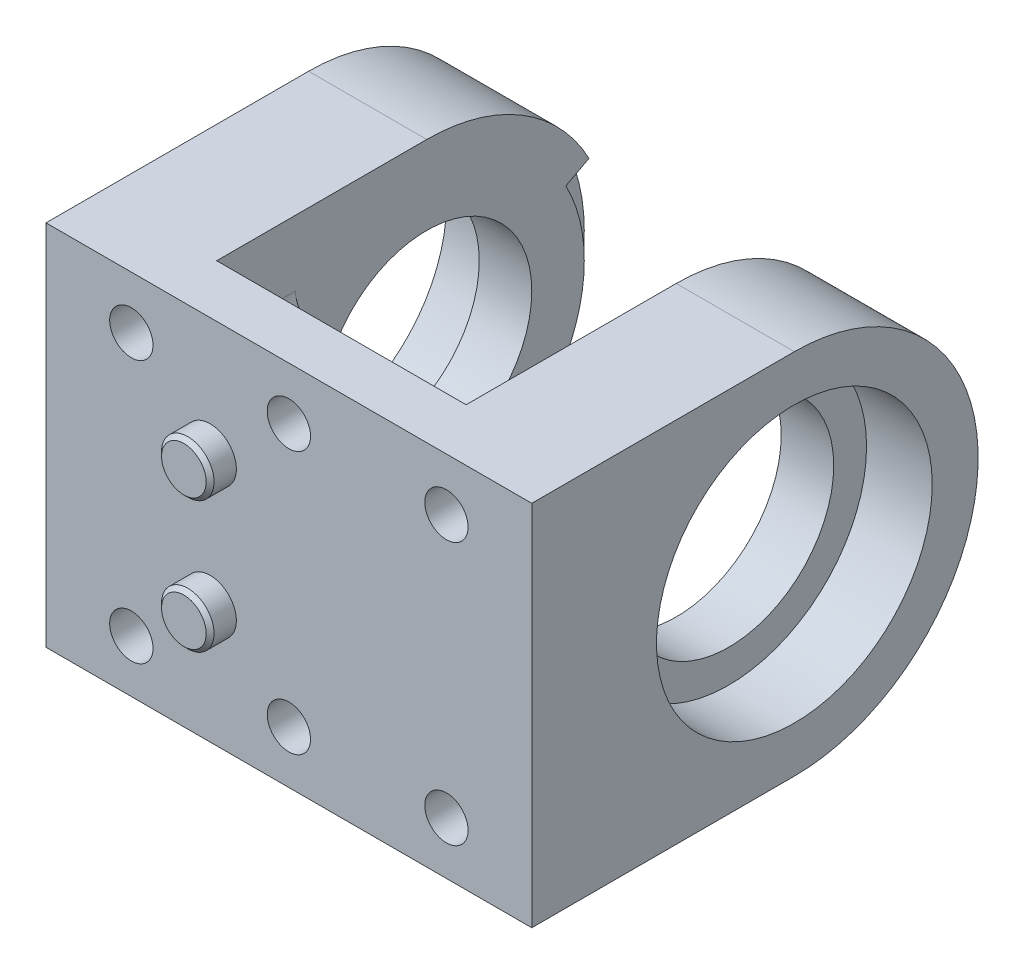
ISO-10303-21;
HEADER;
FILE_DESCRIPTION(('STEP AP214'),'2;1');
FILE_NAME('part.step','',(''),(''),'','','');
FILE_SCHEMA(('AUTOMOTIVE_DESIGN { 1 0 10303 214 1 1 1 1 }'));
ENDSEC;
DATA;
#1=APPLICATION_CONTEXT('core data for automotive mechanical design processes');
#2=APPLICATION_PROTOCOL_DEFINITION('international standard','automotive_design',2000,#1);
#3=PRODUCT_CONTEXT('',#1,'mechanical');
#4=PRODUCT('Part','Part','',(#3));
#5=PRODUCT_RELATED_PRODUCT_CATEGORY('part','',(#4));
#6=PRODUCT_DEFINITION_FORMATION('','',#4);
#7=PRODUCT_DEFINITION_CONTEXT('part definition',#1,'design');
#8=PRODUCT_DEFINITION('design','',#6,#7);
#9=PRODUCT_DEFINITION_SHAPE('','',#8);
#10=(LENGTH_UNIT() NAMED_UNIT(*) SI_UNIT(.MILLI.,.METRE.));
#11=(NAMED_UNIT(*) PLANE_ANGLE_UNIT() SI_UNIT($,.RADIAN.));
#12=(NAMED_UNIT(*) SI_UNIT($,.STERADIAN.) SOLID_ANGLE_UNIT());
#13=UNCERTAINTY_MEASURE_WITH_UNIT(LENGTH_MEASURE(1.E-05),#10,'distance_accuracy_value','');
#14=(GEOMETRIC_REPRESENTATION_CONTEXT(3) GLOBAL_UNCERTAINTY_ASSIGNED_CONTEXT((#13)) GLOBAL_UNIT_ASSIGNED_CONTEXT((#10,
#11,#12)) REPRESENTATION_CONTEXT('',''));
#15=CARTESIAN_POINT('',(0.,0.,0.));
#16=DIRECTION('',(0.,0.,1.));
#17=DIRECTION('',(1.,0.,0.));
#18=AXIS2_PLACEMENT_3D('',#15,#16,#17);
#19=CARTESIAN_POINT('',(0.,0.,0.));
#20=DIRECTION('',(0.,0.,-1.));
#21=DIRECTION('',(-1.,0.,0.));
#22=AXIS2_PLACEMENT_3D('',#19,#20,#21);
#23=PLANE('',#22);
#24=CARTESIAN_POINT('',(0.,-10.,0.));
#25=DIRECTION('',(0.,0.,-1.));
#26=DIRECTION('',(-1.,0.,0.));
#27=AXIS2_PLACEMENT_3D('',#24,#25,#26);
#28=CIRCLE('',#27,1.64999999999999);
#29=CARTESIAN_POINT('',(-1.64999999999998,-10.,0.));
#30=VERTEX_POINT('',#29);
#31=EDGE_CURVE('E277',#30,#30,#28,.T.);
#32=ORIENTED_EDGE('',*,*,#31,.F.);
#33=EDGE_LOOP('',(#32));
#34=FACE_BOUND('',#33,.T.);
#35=DIRECTION('',(0.,-1.,0.));
#36=VECTOR('',#35,1.);
#37=CARTESIAN_POINT('',(-9.5,14.,0.));
#38=LINE('',#37,#36);
#39=CARTESIAN_POINT('',(-9.5,-9.,0.));
#40=VERTEX_POINT('',#39);
#41=CARTESIAN_POINT('',(-9.5,-14.,0.));
#42=VERTEX_POINT('',#41);
#43=EDGE_CURVE('E352',#40,#42,#38,.T.);
#44=ORIENTED_EDGE('',*,*,#43,.F.);
#45=CARTESIAN_POINT('',(-7.5,-9.,0.));
#46=DIRECTION('',(0.,0.,-1.));
#47=DIRECTION('',(-1.,0.,0.));
#48=AXIS2_PLACEMENT_3D('',#45,#46,#47);
#49=CIRCLE('',#48,2.);
#50=CARTESIAN_POINT('',(-7.50000000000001,-7.,0.));
#51=VERTEX_POINT('',#50);
#52=EDGE_CURVE('E475',#40,#51,#49,.T.);
#53=ORIENTED_EDGE('',*,*,#52,.T.);
#54=DIRECTION('',(-1.,0.,0.));
#55=VECTOR('',#54,1.);
#56=CARTESIAN_POINT('',(9.5,-7.,0.));
#57=LINE('',#56,#55);
#58=CARTESIAN_POINT('',(7.5,-7.,0.));
#59=VERTEX_POINT('',#58);
#60=EDGE_CURVE('E304',#59,#51,#57,.T.);
#61=ORIENTED_EDGE('',*,*,#60,.F.);
#62=CARTESIAN_POINT('',(7.5,-9.,0.));
#63=DIRECTION('',(0.,0.,-1.));
#64=DIRECTION('',(-1.,0.,0.));
#65=AXIS2_PLACEMENT_3D('',#62,#63,#64);
#66=CIRCLE('',#65,2.);
#67=CARTESIAN_POINT('',(9.5,-9.,0.));
#68=VERTEX_POINT('',#67);
#69=EDGE_CURVE('E473',#59,#68,#66,.T.);
#70=ORIENTED_EDGE('',*,*,#69,.T.);
#71=DIRECTION('',(0.,-1.,0.));
#72=VECTOR('',#71,1.);
#73=CARTESIAN_POINT('',(9.5,14.,0.));
#74=LINE('',#73,#72);
#75=CARTESIAN_POINT('',(9.5,-14.,0.));
#76=VERTEX_POINT('',#75);
#77=EDGE_CURVE('E379',#68,#76,#74,.T.);
#78=ORIENTED_EDGE('',*,*,#77,.T.);
#79=DIRECTION('',(1.,0.,0.));
#80=VECTOR('',#79,1.);
#81=CARTESIAN_POINT('',(-18.5,-14.,0.));
#82=LINE('',#81,#80);
#83=EDGE_CURVE('E403',#42,#76,#82,.T.);
#84=ORIENTED_EDGE('',*,*,#83,.F.);
#85=EDGE_LOOP('',(#44,#53,#61,#70,#78,#84));
#86=FACE_BOUND('',#85,.T.);
#87=ADVANCED_FACE('F40',(#34,#86),#23,.T.);
#88=DIRECTION('',(1.,0.,0.));
#89=VECTOR('',#88,1.);
#90=CARTESIAN_POINT('',(9.5,-3.,0.));
#91=LINE('',#90,#89);
#92=CARTESIAN_POINT('',(-7.50000000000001,-3.,0.));
#93=VERTEX_POINT('',#92);
#94=CARTESIAN_POINT('',(7.5,-3.,0.));
#95=VERTEX_POINT('',#94);
#96=EDGE_CURVE('E309',#93,#95,#91,.T.);
#97=ORIENTED_EDGE('',*,*,#96,.F.);
#98=CARTESIAN_POINT('',(-7.50000000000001,-1.,0.));
#99=DIRECTION('',(0.,0.,-1.));
#100=DIRECTION('',(-1.,0.,0.));
#101=AXIS2_PLACEMENT_3D('',#98,#99,#100);
#102=CIRCLE('',#101,2.);
#103=CARTESIAN_POINT('',(-9.5,-1.,0.));
#104=VERTEX_POINT('',#103);
#105=EDGE_CURVE('E442',#93,#104,#102,.T.);
#106=ORIENTED_EDGE('',*,*,#105,.T.);
#107=CARTESIAN_POINT('',(-9.5,1.,0.));
#108=VERTEX_POINT('',#107);
#109=EDGE_CURVE('E357',#108,#104,#38,.T.);
#110=ORIENTED_EDGE('',*,*,#109,.F.);
#111=CARTESIAN_POINT('',(-7.5,1.,0.));
#112=DIRECTION('',(0.,0.,-1.));
#113=DIRECTION('',(-1.,0.,0.));
#114=AXIS2_PLACEMENT_3D('',#111,#112,#113);
#115=CIRCLE('',#114,2.);
#116=CARTESIAN_POINT('',(-7.50000000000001,3.,0.));
#117=VERTEX_POINT('',#116);
#118=EDGE_CURVE('E436',#108,#117,#115,.T.);
#119=ORIENTED_EDGE('',*,*,#118,.T.);
#120=DIRECTION('',(-1.,0.,0.));
#121=VECTOR('',#120,1.);
#122=CARTESIAN_POINT('',(9.5,3.,0.));
#123=LINE('',#122,#121);
#124=CARTESIAN_POINT('',(7.5,3.,0.));
#125=VERTEX_POINT('',#124);
#126=EDGE_CURVE('E316',#125,#117,#123,.T.);
#127=ORIENTED_EDGE('',*,*,#126,.F.);
#128=CARTESIAN_POINT('',(7.5,1.,0.));
#129=DIRECTION('',(0.,0.,-1.));
#130=DIRECTION('',(-1.,0.,0.));
#131=AXIS2_PLACEMENT_3D('',#128,#129,#130);
#132=CIRCLE('',#131,2.);
#133=CARTESIAN_POINT('',(9.5,0.999999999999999,0.));
#134=VERTEX_POINT('',#133);
#135=EDGE_CURVE('E438',#125,#134,#132,.T.);
#136=ORIENTED_EDGE('',*,*,#135,.T.);
#137=CARTESIAN_POINT('',(9.5,-0.999999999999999,0.));
#138=VERTEX_POINT('',#137);
#139=EDGE_CURVE('E384',#134,#138,#74,.T.);
#140=ORIENTED_EDGE('',*,*,#139,.T.);
#141=CARTESIAN_POINT('',(7.5,-1.,0.));
#142=DIRECTION('',(0.,0.,-1.));
#143=DIRECTION('',(-1.,0.,0.));
#144=AXIS2_PLACEMENT_3D('',#141,#142,#143);
#145=CIRCLE('',#144,2.);
#146=EDGE_CURVE('E440',#138,#95,#145,.T.);
#147=ORIENTED_EDGE('',*,*,#146,.T.);
#148=EDGE_LOOP('',(#97,#106,#110,#119,#127,#136,#140,#147));
#149=FACE_BOUND('',#148,.T.);
#150=ADVANCED_FACE('F529',(#149),#23,.T.);
#151=CARTESIAN_POINT('',(9.5,0.,-16.));
#152=DIRECTION('',(1.,0.,0.));
#153=DIRECTION('',(0.,0.,-1.));
#154=AXIS2_PLACEMENT_3D('',#151,#152,#153);
#155=PLANE('',#154);
#156=CARTESIAN_POINT('',(9.5,0.,-16.));
#157=DIRECTION('',(1.,0.,0.));
#158=DIRECTION('',(0.,0.,-1.));
#159=AXIS2_PLACEMENT_3D('',#156,#157,#158);
#160=CIRCLE('',#159,8.);
#161=CARTESIAN_POINT('',(9.5,0.,-24.));
#162=VERTEX_POINT('',#161);
#163=EDGE_CURVE('E372',#162,#162,#160,.T.);
#164=ORIENTED_EDGE('',*,*,#163,.T.);
#165=EDGE_LOOP('',(#164));
#166=FACE_BOUND('',#165,.T.);
#167=DIRECTION('',(0.,-1.,0.));
#168=VECTOR('',#167,1.);
#169=CARTESIAN_POINT('',(9.5,-7.,-6.));
#170=LINE('',#169,#168);
#171=CARTESIAN_POINT('',(9.5,-1.,-6.));
#172=VERTEX_POINT('',#171);
#173=CARTESIAN_POINT('',(9.5,-9.,-6.));
#174=VERTEX_POINT('',#173);
#175=EDGE_CURVE('E314',#172,#174,#170,.T.);
#176=ORIENTED_EDGE('',*,*,#175,.F.);
#177=DIRECTION('',(0.,0.,1.));
#178=VECTOR('',#177,1.);
#179=CARTESIAN_POINT('',(9.5,-1.,0.));
#180=LINE('',#179,#178);
#181=EDGE_CURVE('E465',#172,#138,#180,.T.);
#182=ORIENTED_EDGE('',*,*,#181,.T.);
#183=ORIENTED_EDGE('',*,*,#139,.F.);
#184=DIRECTION('',(0.,0.,1.));
#185=VECTOR('',#184,1.);
#186=CARTESIAN_POINT('',(9.5,1.,-6.));
#187=LINE('',#186,#185);
#188=CARTESIAN_POINT('',(9.5,1.,-6.));
#189=VERTEX_POINT('',#188);
#190=EDGE_CURVE('E462',#134,#189,#187,.F.);
#191=ORIENTED_EDGE('',*,*,#190,.T.);
#192=DIRECTION('',(0.,-1.,0.));
#193=VECTOR('',#192,1.);
#194=CARTESIAN_POINT('',(9.5,7.,-6.));
#195=LINE('',#194,#193);
#196=CARTESIAN_POINT('',(9.5,9.,-6.));
#197=VERTEX_POINT('',#196);
#198=EDGE_CURVE('E321',#197,#189,#195,.T.);
#199=ORIENTED_EDGE('',*,*,#198,.F.);
#200=DIRECTION('',(0.,0.,1.));
#201=VECTOR('',#200,1.);
#202=CARTESIAN_POINT('',(9.5,9.,0.));
#203=LINE('',#202,#201);
#204=CARTESIAN_POINT('',(9.5,9.,0.));
#205=VERTEX_POINT('',#204);
#206=EDGE_CURVE('E456',#197,#205,#203,.T.);
#207=ORIENTED_EDGE('',*,*,#206,.T.);
#208=CARTESIAN_POINT('',(9.5,14.,0.));
#209=VERTEX_POINT('',#208);
#210=EDGE_CURVE('E380',#209,#205,#74,.T.);
#211=ORIENTED_EDGE('',*,*,#210,.F.);
#212=DIRECTION('',(0.,0.,1.));
#213=VECTOR('',#212,1.);
#214=CARTESIAN_POINT('',(9.5,14.,-16.));
#215=LINE('',#214,#213);
#216=CARTESIAN_POINT('',(9.5,14.,-16.));
#217=VERTEX_POINT('',#216);
#218=EDGE_CURVE('E376',#217,#209,#215,.T.);
#219=ORIENTED_EDGE('',*,*,#218,.F.);
#220=CARTESIAN_POINT('',(9.5,0.,-16.));
#221=DIRECTION('',(1.,0.,0.));
#222=DIRECTION('',(0.,0.,-1.));
#223=AXIS2_PLACEMENT_3D('',#220,#221,#222);
#224=CIRCLE('',#223,14.);
#225=CARTESIAN_POINT('',(9.5,-14.,-16.));
#226=VERTEX_POINT('',#225);
#227=EDGE_CURVE('E387',#226,#217,#224,.T.);
#228=ORIENTED_EDGE('',*,*,#227,.F.);
#229=DIRECTION('',(0.,0.,-1.));
#230=VECTOR('',#229,1.);
#231=CARTESIAN_POINT('',(9.5,-14.,0.));
#232=LINE('',#231,#230);
#233=EDGE_CURVE('E383',#76,#226,#232,.T.);
#234=ORIENTED_EDGE('',*,*,#233,.F.);
#235=ORIENTED_EDGE('',*,*,#77,.F.);
#236=DIRECTION('',(0.,0.,1.));
#237=VECTOR('',#236,1.);
#238=CARTESIAN_POINT('',(9.5,-9.,-6.));
#239=LINE('',#238,#237);
#240=EDGE_CURVE('E459',#68,#174,#239,.F.);
#241=ORIENTED_EDGE('',*,*,#240,.T.);
#242=EDGE_LOOP('',(#176,#182,#183,#191,#199,#207,#211,#219,#228,#234,#235,#241));
#243=FACE_BOUND('',#242,.T.);
#244=ADVANCED_FACE('F536',(#166,#243),#155,.F.);
#245=CARTESIAN_POINT('',(-9.5,0.,-16.));
#246=DIRECTION('',(-1.,0.,0.));
#247=DIRECTION('',(0.,0.,-1.));
#248=AXIS2_PLACEMENT_3D('',#245,#246,#247);
#249=PLANE('',#248);
#250=CARTESIAN_POINT('',(-9.5,0.,-16.));
#251=DIRECTION('',(1.,0.,0.));
#252=DIRECTION('',(0.,0.,-1.));
#253=AXIS2_PLACEMENT_3D('',#250,#251,#252);
#254=CIRCLE('',#253,8.);
#255=CARTESIAN_POINT('',(-9.5,0.,-24.));
#256=VERTEX_POINT('',#255);
#257=EDGE_CURVE('E341',#256,#256,#254,.T.);
#258=ORIENTED_EDGE('',*,*,#257,.F.);
#259=EDGE_LOOP('',(#258));
#260=FACE_BOUND('',#259,.T.);
#261=CARTESIAN_POINT('',(-9.5,0.,-16.));
#262=DIRECTION('',(1.,0.,0.));
#263=DIRECTION('',(0.,0.,-1.));
#264=AXIS2_PLACEMENT_3D('',#261,#262,#263);
#265=CIRCLE('',#264,14.);
#266=CARTESIAN_POINT('',(-9.5,-14.,-16.));
#267=VERTEX_POINT('',#266);
#268=CARTESIAN_POINT('',(-9.5,-6.57260187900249,-28.361266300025));
#269=VERTEX_POINT('',#268);
#270=EDGE_CURVE('E347',#267,#269,#265,.T.);
#271=ORIENTED_EDGE('',*,*,#270,.T.);
#272=DIRECTION('',(0.,-0.469471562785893,-0.882947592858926));
#273=VECTOR('',#272,1.);
#274=CARTESIAN_POINT('',(-9.5,-5.6336587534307,-26.5953711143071));
#275=LINE('',#274,#273);
#276=CARTESIAN_POINT('',(-9.5,-5.6336587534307,-26.5953711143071));
#277=VERTEX_POINT('',#276);
#278=EDGE_CURVE('E255',#277,#269,#275,.T.);
#279=ORIENTED_EDGE('',*,*,#278,.F.);
#280=CARTESIAN_POINT('',(-9.5,0.,-16.));
#281=DIRECTION('',(-1.,0.,0.));
#282=DIRECTION('',(0.,0.,-1.));
#283=AXIS2_PLACEMENT_3D('',#280,#281,#282);
#284=CIRCLE('',#283,12.);
#285=CARTESIAN_POINT('',(-9.5,5.6336587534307,-26.5953711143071));
#286=VERTEX_POINT('',#285);
#287=EDGE_CURVE('E646',#286,#277,#284,.T.);
#288=ORIENTED_EDGE('',*,*,#287,.F.);
#289=DIRECTION('',(0.,-0.469471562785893,0.882947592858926));
#290=VECTOR('',#289,1.);
#291=CARTESIAN_POINT('',(-9.5,5.6336587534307,-26.5953711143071));
#292=LINE('',#291,#290);
#293=CARTESIAN_POINT('',(-9.5,6.57260187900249,-28.361266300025));
#294=VERTEX_POINT('',#293);
#295=EDGE_CURVE('E649',#294,#286,#292,.T.);
#296=ORIENTED_EDGE('',*,*,#295,.F.);
#297=CARTESIAN_POINT('',(-9.5,14.,-16.));
#298=VERTEX_POINT('',#297);
#299=EDGE_CURVE('E260',#294,#298,#265,.T.);
#300=ORIENTED_EDGE('',*,*,#299,.T.);
#301=DIRECTION('',(0.,0.,1.));
#302=VECTOR('',#301,1.);
#303=CARTESIAN_POINT('',(-9.5,14.,-16.));
#304=LINE('',#303,#302);
#305=CARTESIAN_POINT('',(-9.5,14.,0.));
#306=VERTEX_POINT('',#305);
#307=EDGE_CURVE('E345',#298,#306,#304,.T.);
#308=ORIENTED_EDGE('',*,*,#307,.T.);
#309=CARTESIAN_POINT('',(-9.5,9.,0.));
#310=VERTEX_POINT('',#309);
#311=EDGE_CURVE('E353',#306,#310,#38,.T.);
#312=ORIENTED_EDGE('',*,*,#311,.T.);
#313=DIRECTION('',(0.,0.,1.));
#314=VECTOR('',#313,1.);
#315=CARTESIAN_POINT('',(-9.5,9.,-6.));
#316=LINE('',#315,#314);
#317=CARTESIAN_POINT('',(-9.5,9.,-6.));
#318=VERTEX_POINT('',#317);
#319=EDGE_CURVE('E444',#310,#318,#316,.F.);
#320=ORIENTED_EDGE('',*,*,#319,.T.);
#321=DIRECTION('',(0.,1.,0.));
#322=VECTOR('',#321,1.);
#323=CARTESIAN_POINT('',(-9.5,7.,-6.));
#324=LINE('',#323,#322);
#325=CARTESIAN_POINT('',(-9.5,1.,-6.));
#326=VERTEX_POINT('',#325);
#327=EDGE_CURVE('E327',#326,#318,#324,.T.);
#328=ORIENTED_EDGE('',*,*,#327,.F.);
#329=DIRECTION('',(0.,0.,1.));
#330=VECTOR('',#329,1.);
#331=CARTESIAN_POINT('',(-9.5,1.,0.));
#332=LINE('',#331,#330);
#333=EDGE_CURVE('E450',#326,#108,#332,.T.);
#334=ORIENTED_EDGE('',*,*,#333,.T.);
#335=ORIENTED_EDGE('',*,*,#109,.T.);
#336=DIRECTION('',(0.,0.,1.));
#337=VECTOR('',#336,1.);
#338=CARTESIAN_POINT('',(-9.5,-1.,-6.));
#339=LINE('',#338,#337);
#340=CARTESIAN_POINT('',(-9.5,-1.,-6.));
#341=VERTEX_POINT('',#340);
#342=EDGE_CURVE('E453',#104,#341,#339,.F.);
#343=ORIENTED_EDGE('',*,*,#342,.T.);
#344=DIRECTION('',(0.,1.,0.));
#345=VECTOR('',#344,1.);
#346=CARTESIAN_POINT('',(-9.5,-7.,-6.));
#347=LINE('',#346,#345);
#348=CARTESIAN_POINT('',(-9.5,-9.,-6.));
#349=VERTEX_POINT('',#348);
#350=EDGE_CURVE('E308',#349,#341,#347,.T.);
#351=ORIENTED_EDGE('',*,*,#350,.F.);
#352=DIRECTION('',(0.,0.,1.));
#353=VECTOR('',#352,1.);
#354=CARTESIAN_POINT('',(-9.5,-9.,0.));
#355=LINE('',#354,#353);
#356=EDGE_CURVE('E447',#349,#40,#355,.T.);
#357=ORIENTED_EDGE('',*,*,#356,.T.);
#358=ORIENTED_EDGE('',*,*,#43,.T.);
#359=DIRECTION('',(0.,0.,-1.));
#360=VECTOR('',#359,1.);
#361=CARTESIAN_POINT('',(-9.5,-14.,0.));
#362=LINE('',#361,#360);
#363=EDGE_CURVE('E350',#42,#267,#362,.T.);
#364=ORIENTED_EDGE('',*,*,#363,.T.);
#365=EDGE_LOOP('',(#271,#279,#288,#296,#300,#308,#312,#320,#328,#334,#335,#343,#351,#357,#358,#364));
#366=FACE_BOUND('',#365,.T.);
#367=ADVANCED_FACE('F544',(#260,#366),#249,.F.);
#368=CARTESIAN_POINT('',(0.,10.,0.));
#369=DIRECTION('',(0.,0.,-1.));
#370=DIRECTION('',(-1.,0.,0.));
#371=AXIS2_PLACEMENT_3D('',#368,#369,#370);
#372=CIRCLE('',#371,1.64999999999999);
#373=CARTESIAN_POINT('',(-1.64999999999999,10.,0.));
#374=VERTEX_POINT('',#373);
#375=EDGE_CURVE('E295',#374,#374,#372,.T.);
#376=ORIENTED_EDGE('',*,*,#375,.F.);
#377=EDGE_LOOP('',(#376));
#378=FACE_BOUND('',#377,.T.);
#379=DIRECTION('',(1.,0.,0.));
#380=VECTOR('',#379,1.);
#381=CARTESIAN_POINT('',(9.5,7.,0.));
#382=LINE('',#381,#380);
#383=CARTESIAN_POINT('',(-7.50000000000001,7.,0.));
#384=VERTEX_POINT('',#383);
#385=CARTESIAN_POINT('',(7.5,7.,0.));
#386=VERTEX_POINT('',#385);
#387=EDGE_CURVE('E324',#384,#386,#382,.T.);
#388=ORIENTED_EDGE('',*,*,#387,.F.);
#389=CARTESIAN_POINT('',(-7.50000000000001,9.,0.));
#390=DIRECTION('',(0.,0.,-1.));
#391=DIRECTION('',(-1.,0.,0.));
#392=AXIS2_PLACEMENT_3D('',#389,#390,#391);
#393=CIRCLE('',#392,2.);
#394=EDGE_CURVE('E488',#384,#310,#393,.T.);
#395=ORIENTED_EDGE('',*,*,#394,.T.);
#396=ORIENTED_EDGE('',*,*,#311,.F.);
#397=DIRECTION('',(-1.,0.,0.));
#398=VECTOR('',#397,1.);
#399=CARTESIAN_POINT('',(-18.5,14.,0.));
#400=LINE('',#399,#398);
#401=EDGE_CURVE('E396',#209,#306,#400,.T.);
#402=ORIENTED_EDGE('',*,*,#401,.F.);
#403=ORIENTED_EDGE('',*,*,#210,.T.);
#404=CARTESIAN_POINT('',(7.5,9.,0.));
#405=DIRECTION('',(0.,0.,-1.));
#406=DIRECTION('',(-1.,0.,0.));
#407=AXIS2_PLACEMENT_3D('',#404,#405,#406);
#408=CIRCLE('',#407,2.);
#409=EDGE_CURVE('E486',#205,#386,#408,.T.);
#410=ORIENTED_EDGE('',*,*,#409,.T.);
#411=EDGE_LOOP('',(#388,#395,#396,#402,#403,#410));
#412=FACE_BOUND('',#411,.T.);
#413=ADVANCED_FACE('F532',(#378,#412),#23,.T.);
#414=CARTESIAN_POINT('',(-9.5,0.,-16.));
#415=DIRECTION('',(-1.,0.,0.));
#416=DIRECTION('',(0.,0.,1.));
#417=AXIS2_PLACEMENT_3D('',#414,#415,#416);
#418=CYLINDRICAL_SURFACE('',#417,8.);
#419=ORIENTED_EDGE('',*,*,#257,.T.);
#420=EDGE_LOOP('',(#419));
#421=FACE_BOUND('',#420,.T.);
#422=CARTESIAN_POINT('',(-13.5,0.,-16.));
#423=DIRECTION('',(-1.,0.,0.));
#424=DIRECTION('',(0.,0.,1.));
#425=AXIS2_PLACEMENT_3D('',#422,#423,#424);
#426=CIRCLE('',#425,8.);
#427=CARTESIAN_POINT('',(-13.5,0.,-8.));
#428=VERTEX_POINT('',#427);
#429=EDGE_CURVE('E338',#428,#428,#426,.T.);
#430=ORIENTED_EDGE('',*,*,#429,.T.);
#431=EDGE_LOOP('',(#430));
#432=FACE_BOUND('',#431,.T.);
#433=ADVANCED_FACE('F543',(#421,#432),#418,.F.);
#434=CARTESIAN_POINT('',(9.5,0.,-16.));
#435=DIRECTION('',(1.,0.,0.));
#436=DIRECTION('',(0.,0.,-1.));
#437=AXIS2_PLACEMENT_3D('',#434,#435,#436);
#438=CYLINDRICAL_SURFACE('',#437,8.);
#439=ORIENTED_EDGE('',*,*,#163,.F.);
#440=EDGE_LOOP('',(#439));
#441=FACE_BOUND('',#440,.T.);
#442=CARTESIAN_POINT('',(13.5,0.,-16.));
#443=DIRECTION('',(1.,0.,0.));
#444=DIRECTION('',(0.,0.,-1.));
#445=AXIS2_PLACEMENT_3D('',#442,#443,#444);
#446=CIRCLE('',#445,8.);
#447=CARTESIAN_POINT('',(13.5,0.,-24.));
#448=VERTEX_POINT('',#447);
#449=EDGE_CURVE('E369',#448,#448,#446,.F.);
#450=ORIENTED_EDGE('',*,*,#449,.F.);
#451=EDGE_LOOP('',(#450));
#452=FACE_BOUND('',#451,.T.);
#453=ADVANCED_FACE('F550',(#441,#452),#438,.F.);
#454=CARTESIAN_POINT('',(0.,0.,4.));
#455=DIRECTION('',(0.,0.,-1.));
#456=DIRECTION('',(-1.,0.,0.));
#457=AXIS2_PLACEMENT_3D('',#454,#455,#456);
#458=PLANE('',#457);
#459=CARTESIAN_POINT('',(12.,-9.99999999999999,4.));
#460=DIRECTION('',(0.,0.,1.));
#461=DIRECTION('',(1.,0.,0.));
#462=AXIS2_PLACEMENT_3D('',#459,#460,#461);
#463=CIRCLE('',#462,1.64999999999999);
#464=CARTESIAN_POINT('',(13.65,-9.99999999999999,4.));
#465=VERTEX_POINT('',#464);
#466=EDGE_CURVE('E267',#465,#465,#463,.T.);
#467=ORIENTED_EDGE('',*,*,#466,.F.);
#468=EDGE_LOOP('',(#467));
#469=FACE_BOUND('',#468,.T.);
#470=CARTESIAN_POINT('',(0.,-10.,4.));
#471=DIRECTION('',(0.,0.,1.));
#472=DIRECTION('',(1.,0.,0.));
#473=AXIS2_PLACEMENT_3D('',#470,#471,#472);
#474=CIRCLE('',#473,1.64999999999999);
#475=CARTESIAN_POINT('',(1.65,-10.,4.));
#476=VERTEX_POINT('',#475);
#477=EDGE_CURVE('E274',#476,#476,#474,.T.);
#478=ORIENTED_EDGE('',*,*,#477,.F.);
#479=EDGE_LOOP('',(#478));
#480=FACE_BOUND('',#479,.T.);
#481=CARTESIAN_POINT('',(-12.,-10.,4.));
#482=DIRECTION('',(0.,0.,1.));
#483=DIRECTION('',(1.,0.,0.));
#484=AXIS2_PLACEMENT_3D('',#481,#482,#483);
#485=CIRCLE('',#484,1.64999999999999);
#486=CARTESIAN_POINT('',(-10.35,-10.,4.));
#487=VERTEX_POINT('',#486);
#488=EDGE_CURVE('E280',#487,#487,#485,.T.);
#489=ORIENTED_EDGE('',*,*,#488,.F.);
#490=EDGE_LOOP('',(#489));
#491=FACE_BOUND('',#490,.T.);
#492=CARTESIAN_POINT('',(-12.,10.,4.));
#493=DIRECTION('',(0.,0.,1.));
#494=DIRECTION('',(1.,0.,0.));
#495=AXIS2_PLACEMENT_3D('',#492,#493,#494);
#496=CIRCLE('',#495,1.64999999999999);
#497=CARTESIAN_POINT('',(-10.35,10.,4.));
#498=VERTEX_POINT('',#497);
#499=EDGE_CURVE('E286',#498,#498,#496,.T.);
#500=ORIENTED_EDGE('',*,*,#499,.F.);
#501=EDGE_LOOP('',(#500));
#502=FACE_BOUND('',#501,.T.);
#503=CARTESIAN_POINT('',(0.,10.,4.));
#504=DIRECTION('',(0.,0.,1.));
#505=DIRECTION('',(1.,0.,0.));
#506=AXIS2_PLACEMENT_3D('',#503,#504,#505);
#507=CIRCLE('',#506,1.64999999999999);
#508=CARTESIAN_POINT('',(1.64999999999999,10.,4.));
#509=VERTEX_POINT('',#508);
#510=EDGE_CURVE('E292',#509,#509,#507,.T.);
#511=ORIENTED_EDGE('',*,*,#510,.F.);
#512=EDGE_LOOP('',(#511));
#513=FACE_BOUND('',#512,.T.);
#514=CARTESIAN_POINT('',(12.,10.,4.));
#515=DIRECTION('',(0.,0.,1.));
#516=DIRECTION('',(1.,0.,0.));
#517=AXIS2_PLACEMENT_3D('',#514,#515,#516);
#518=CIRCLE('',#517,1.64999999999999);
#519=CARTESIAN_POINT('',(13.65,10.,4.));
#520=VERTEX_POINT('',#519);
#521=EDGE_CURVE('E298',#520,#520,#518,.T.);
#522=ORIENTED_EDGE('',*,*,#521,.F.);
#523=EDGE_LOOP('',(#522));
#524=FACE_BOUND('',#523,.T.);
#525=CARTESIAN_POINT('',(-5.99999999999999,-5.,4.));
#526=DIRECTION('',(0.,0.,-1.));
#527=DIRECTION('',(-1.,0.,0.));
#528=AXIS2_PLACEMENT_3D('',#525,#526,#527);
#529=CIRCLE('',#528,2.);
#530=CARTESIAN_POINT('',(-7.99999999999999,-5.,4.));
#531=VERTEX_POINT('',#530);
#532=EDGE_CURVE('E424',#531,#531,#529,.F.);
#533=ORIENTED_EDGE('',*,*,#532,.F.);
#534=EDGE_LOOP('',(#533));
#535=FACE_BOUND('',#534,.T.);
#536=CARTESIAN_POINT('',(-5.99999999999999,5.,4.));
#537=DIRECTION('',(0.,0.,-1.));
#538=DIRECTION('',(-1.,0.,0.));
#539=AXIS2_PLACEMENT_3D('',#536,#537,#538);
#540=CIRCLE('',#539,2.);
#541=CARTESIAN_POINT('',(-7.99999999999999,5.,4.));
#542=VERTEX_POINT('',#541);
#543=EDGE_CURVE('E421',#542,#542,#540,.F.);
#544=ORIENTED_EDGE('',*,*,#543,.F.);
#545=EDGE_LOOP('',(#544));
#546=FACE_BOUND('',#545,.T.);
#547=DIRECTION('',(0.,1.,0.));
#548=VECTOR('',#547,1.);
#549=CARTESIAN_POINT('',(18.5,-14.,4.));
#550=LINE('',#549,#548);
#551=CARTESIAN_POINT('',(18.5,-14.,4.));
#552=VERTEX_POINT('',#551);
#553=CARTESIAN_POINT('',(18.5,14.,4.));
#554=VERTEX_POINT('',#553);
#555=EDGE_CURVE('E399',#552,#554,#550,.T.);
#556=ORIENTED_EDGE('',*,*,#555,.T.);
#557=DIRECTION('',(-1.,0.,0.));
#558=VECTOR('',#557,1.);
#559=CARTESIAN_POINT('',(-18.5,14.,4.));
#560=LINE('',#559,#558);
#561=CARTESIAN_POINT('',(-18.5,14.,4.));
#562=VERTEX_POINT('',#561);
#563=EDGE_CURVE('E402',#554,#562,#560,.T.);
#564=ORIENTED_EDGE('',*,*,#563,.T.);
#565=DIRECTION('',(0.,-1.,0.));
#566=VECTOR('',#565,1.);
#567=CARTESIAN_POINT('',(-18.5,-14.,4.));
#568=LINE('',#567,#566);
#569=CARTESIAN_POINT('',(-18.5,-14.,4.));
#570=VERTEX_POINT('',#569);
#571=EDGE_CURVE('E405',#562,#570,#568,.T.);
#572=ORIENTED_EDGE('',*,*,#571,.T.);
#573=DIRECTION('',(1.,0.,0.));
#574=VECTOR('',#573,1.);
#575=CARTESIAN_POINT('',(-18.5,-14.,4.));
#576=LINE('',#575,#574);
#577=EDGE_CURVE('E407',#570,#552,#576,.T.);
#578=ORIENTED_EDGE('',*,*,#577,.T.);
#579=EDGE_LOOP('',(#556,#564,#572,#578));
#580=FACE_BOUND('',#579,.T.);
#581=ADVANCED_FACE('F662',(#469,#480,#491,#502,#513,#524,#535,#546,#580),#458,.F.);
#582=CARTESIAN_POINT('',(18.5,-14.,4.));
#583=DIRECTION('',(-1.,0.,0.));
#584=DIRECTION('',(0.,0.,1.));
#585=AXIS2_PLACEMENT_3D('',#582,#583,#584);
#586=PLANE('',#585);
#587=CARTESIAN_POINT('',(18.5,0.,-16.));
#588=DIRECTION('',(1.,0.,0.));
#589=DIRECTION('',(0.,0.,-1.));
#590=AXIS2_PLACEMENT_3D('',#587,#588,#589);
#591=CIRCLE('',#590,10.5);
#592=CARTESIAN_POINT('',(18.5,0.,-26.5));
#593=VERTEX_POINT('',#592);
#594=EDGE_CURVE('E363',#593,#593,#591,.T.);
#595=ORIENTED_EDGE('',*,*,#594,.F.);
#596=EDGE_LOOP('',(#595));
#597=FACE_BOUND('',#596,.T.);
#598=DIRECTION('',(0.,0.,-1.));
#599=VECTOR('',#598,1.);
#600=CARTESIAN_POINT('',(18.5,-14.,4.));
#601=LINE('',#600,#599);
#602=CARTESIAN_POINT('',(18.5,-14.,-16.));
#603=VERTEX_POINT('',#602);
#604=EDGE_CURVE('E409',#552,#603,#601,.T.);
#605=ORIENTED_EDGE('',*,*,#604,.T.);
#606=CARTESIAN_POINT('',(18.5,0.,-16.));
#607=DIRECTION('',(1.,0.,0.));
#608=DIRECTION('',(0.,0.,-1.));
#609=AXIS2_PLACEMENT_3D('',#606,#607,#608);
#610=CIRCLE('',#609,14.);
#611=CARTESIAN_POINT('',(18.5,14.,-16.));
#612=VERTEX_POINT('',#611);
#613=EDGE_CURVE('E375',#603,#612,#610,.T.);
#614=ORIENTED_EDGE('',*,*,#613,.T.);
#615=DIRECTION('',(0.,0.,-1.));
#616=VECTOR('',#615,1.);
#617=CARTESIAN_POINT('',(18.5,14.,4.));
#618=LINE('',#617,#616);
#619=EDGE_CURVE('E419',#554,#612,#618,.T.);
#620=ORIENTED_EDGE('',*,*,#619,.F.);
#621=ORIENTED_EDGE('',*,*,#555,.F.);
#622=EDGE_LOOP('',(#605,#614,#620,#621));
#623=FACE_BOUND('',#622,.T.);
#624=ADVANCED_FACE('F666',(#597,#623),#586,.F.);
#625=CARTESIAN_POINT('',(-18.5,14.,4.));
#626=DIRECTION('',(0.,-1.,0.));
#627=DIRECTION('',(1.,0.,0.));
#628=AXIS2_PLACEMENT_3D('',#625,#626,#627);
#629=PLANE('',#628);
#630=ORIENTED_EDGE('',*,*,#619,.T.);
#631=DIRECTION('',(1.,0.,0.));
#632=VECTOR('',#631,1.);
#633=CARTESIAN_POINT('',(9.5,14.,-16.));
#634=LINE('',#633,#632);
#635=EDGE_CURVE('E393',#217,#612,#634,.T.);
#636=ORIENTED_EDGE('',*,*,#635,.F.);
#637=ORIENTED_EDGE('',*,*,#218,.T.);
#638=ORIENTED_EDGE('',*,*,#401,.T.);
#639=ORIENTED_EDGE('',*,*,#307,.F.);
#640=DIRECTION('',(-1.,0.,0.));
#641=VECTOR('',#640,1.);
#642=CARTESIAN_POINT('',(-9.5,14.,-16.));
#643=LINE('',#642,#641);
#644=CARTESIAN_POINT('',(-18.5,14.,-16.));
#645=VERTEX_POINT('',#644);
#646=EDGE_CURVE('E356',#298,#645,#643,.T.);
#647=ORIENTED_EDGE('',*,*,#646,.T.);
#648=DIRECTION('',(0.,0.,-1.));
#649=VECTOR('',#648,1.);
#650=CARTESIAN_POINT('',(-18.5,14.,4.));
#651=LINE('',#650,#649);
#652=EDGE_CURVE('E417',#562,#645,#651,.T.);
#653=ORIENTED_EDGE('',*,*,#652,.F.);
#654=ORIENTED_EDGE('',*,*,#563,.F.);
#655=EDGE_LOOP('',(#630,#636,#637,#638,#639,#647,#653,#654));
#656=FACE_BOUND('',#655,.T.);
#657=ADVANCED_FACE('F575',(#656),#629,.F.);
#658=CARTESIAN_POINT('',(-18.5,-14.,4.));
#659=DIRECTION('',(1.,0.,0.));
#660=DIRECTION('',(0.,0.,-1.));
#661=AXIS2_PLACEMENT_3D('',#658,#659,#660);
#662=PLANE('',#661);
#663=CARTESIAN_POINT('',(-18.5,0.,-16.));
#664=DIRECTION('',(1.,0.,0.));
#665=DIRECTION('',(0.,0.,-1.));
#666=AXIS2_PLACEMENT_3D('',#663,#664,#665);
#667=CIRCLE('',#666,10.5);
#668=CARTESIAN_POINT('',(-18.5,0.,-26.5));
#669=VERTEX_POINT('',#668);
#670=EDGE_CURVE('E331',#669,#669,#667,.T.);
#671=ORIENTED_EDGE('',*,*,#670,.T.);
#672=EDGE_LOOP('',(#671));
#673=FACE_BOUND('',#672,.T.);
#674=ORIENTED_EDGE('',*,*,#652,.T.);
#675=CARTESIAN_POINT('',(-18.5,0.,-16.));
#676=DIRECTION('',(1.,0.,0.));
#677=DIRECTION('',(0.,0.,-1.));
#678=AXIS2_PLACEMENT_3D('',#675,#676,#677);
#679=CIRCLE('',#678,14.);
#680=CARTESIAN_POINT('',(-18.5,-14.,-16.));
#681=VERTEX_POINT('',#680);
#682=EDGE_CURVE('E344',#681,#645,#679,.T.);
#683=ORIENTED_EDGE('',*,*,#682,.F.);
#684=DIRECTION('',(0.,0.,-1.));
#685=VECTOR('',#684,1.);
#686=CARTESIAN_POINT('',(-18.5,-14.,4.));
#687=LINE('',#686,#685);
#688=EDGE_CURVE('E415',#570,#681,#687,.T.);
#689=ORIENTED_EDGE('',*,*,#688,.F.);
#690=ORIENTED_EDGE('',*,*,#571,.F.);
#691=EDGE_LOOP('',(#674,#683,#689,#690));
#692=FACE_BOUND('',#691,.T.);
#693=ADVANCED_FACE('F660',(#673,#692),#662,.F.);
#694=CARTESIAN_POINT('',(-18.5,-14.,4.));
#695=DIRECTION('',(0.,1.,0.));
#696=DIRECTION('',(0.,0.,1.));
#697=AXIS2_PLACEMENT_3D('',#694,#695,#696);
#698=PLANE('',#697);
#699=ORIENTED_EDGE('',*,*,#688,.T.);
#700=DIRECTION('',(-1.,0.,0.));
#701=VECTOR('',#700,1.);
#702=CARTESIAN_POINT('',(-9.5,-14.,-16.));
#703=LINE('',#702,#701);
#704=EDGE_CURVE('E360',#267,#681,#703,.T.);
#705=ORIENTED_EDGE('',*,*,#704,.F.);
#706=ORIENTED_EDGE('',*,*,#363,.F.);
#707=ORIENTED_EDGE('',*,*,#83,.T.);
#708=ORIENTED_EDGE('',*,*,#233,.T.);
#709=DIRECTION('',(1.,0.,0.));
#710=VECTOR('',#709,1.);
#711=CARTESIAN_POINT('',(9.5,-14.,-16.));
#712=LINE('',#711,#710);
#713=EDGE_CURVE('E390',#226,#603,#712,.T.);
#714=ORIENTED_EDGE('',*,*,#713,.T.);
#715=ORIENTED_EDGE('',*,*,#604,.F.);
#716=ORIENTED_EDGE('',*,*,#577,.F.);
#717=EDGE_LOOP('',(#699,#705,#706,#707,#708,#714,#715,#716));
#718=FACE_BOUND('',#717,.T.);
#719=ADVANCED_FACE('F585',(#718),#698,.F.);
#720=CARTESIAN_POINT('',(-5.99999999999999,5.,6.));
#721=DIRECTION('',(0.,0.,-1.));
#722=DIRECTION('',(-1.,0.,0.));
#723=AXIS2_PLACEMENT_3D('',#720,#721,#722);
#724=CYLINDRICAL_SURFACE('',#723,2.);
#725=CARTESIAN_POINT('',(-5.99999999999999,5.,5.69999999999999));
#726=DIRECTION('',(0.,0.,1.));
#727=DIRECTION('',(1.,0.,0.));
#728=AXIS2_PLACEMENT_3D('',#725,#726,#727);
#729=CIRCLE('',#728,2.);
#730=CARTESIAN_POINT('',(-3.99999999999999,5.,5.69999999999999));
#731=VERTEX_POINT('',#730);
#732=EDGE_CURVE('E513',#731,#731,#729,.F.);
#733=ORIENTED_EDGE('',*,*,#732,.T.);
#734=EDGE_LOOP('',(#733));
#735=FACE_BOUND('',#734,.T.);
#736=ORIENTED_EDGE('',*,*,#543,.T.);
#737=EDGE_LOOP('',(#736));
#738=FACE_BOUND('',#737,.T.);
#739=ADVANCED_FACE('F757',(#735,#738),#724,.T.);
#740=CARTESIAN_POINT('',(-5.99999999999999,5.,6.));
#741=DIRECTION('',(0.,0.,1.));
#742=DIRECTION('',(1.,0.,0.));
#743=AXIS2_PLACEMENT_3D('',#740,#741,#742);
#744=PLANE('',#743);
#745=CARTESIAN_POINT('',(-5.99999999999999,5.,6.));
#746=DIRECTION('',(0.,0.,1.));
#747=DIRECTION('',(1.,0.,0.));
#748=AXIS2_PLACEMENT_3D('',#745,#746,#747);
#749=CIRCLE('',#748,1.69999999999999);
#750=CARTESIAN_POINT('',(-4.3,5.,6.));
#751=VERTEX_POINT('',#750);
#752=EDGE_CURVE('E510',#751,#751,#749,.T.);
#753=ORIENTED_EDGE('',*,*,#752,.T.);
#754=EDGE_LOOP('',(#753));
#755=FACE_BOUND('',#754,.T.);
#756=ADVANCED_FACE('F753',(#755),#744,.T.);
#757=CARTESIAN_POINT('',(-5.99999999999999,-5.,6.));
#758=DIRECTION('',(0.,0.,-1.));
#759=DIRECTION('',(-1.,0.,0.));
#760=AXIS2_PLACEMENT_3D('',#757,#758,#759);
#761=CYLINDRICAL_SURFACE('',#760,2.);
#762=CARTESIAN_POINT('',(-5.99999999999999,-5.,5.69999999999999));
#763=DIRECTION('',(0.,0.,1.));
#764=DIRECTION('',(1.,0.,0.));
#765=AXIS2_PLACEMENT_3D('',#762,#763,#764);
#766=CIRCLE('',#765,2.);
#767=CARTESIAN_POINT('',(-3.99999999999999,-5.,5.69999999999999));
#768=VERTEX_POINT('',#767);
#769=EDGE_CURVE('E11',#768,#768,#766,.F.);
#770=ORIENTED_EDGE('',*,*,#769,.T.);
#771=EDGE_LOOP('',(#770));
#772=FACE_BOUND('',#771,.T.);
#773=ORIENTED_EDGE('',*,*,#532,.T.);
#774=EDGE_LOOP('',(#773));
#775=FACE_BOUND('',#774,.T.);
#776=ADVANCED_FACE('F750',(#772,#775),#761,.T.);
#777=CARTESIAN_POINT('',(-5.99999999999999,-5.,6.));
#778=DIRECTION('',(0.,0.,1.));
#779=DIRECTION('',(1.,0.,0.));
#780=AXIS2_PLACEMENT_3D('',#777,#778,#779);
#781=PLANE('',#780);
#782=CARTESIAN_POINT('',(-5.99999999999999,-5.,6.));
#783=DIRECTION('',(0.,0.,1.));
#784=DIRECTION('',(1.,0.,0.));
#785=AXIS2_PLACEMENT_3D('',#782,#783,#784);
#786=CIRCLE('',#785,1.69999999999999);
#787=CARTESIAN_POINT('',(-4.3,-5.,6.));
#788=VERTEX_POINT('',#787);
#789=EDGE_CURVE('E48',#788,#788,#786,.T.);
#790=ORIENTED_EDGE('',*,*,#789,.T.);
#791=EDGE_LOOP('',(#790));
#792=FACE_BOUND('',#791,.T.);
#793=ADVANCED_FACE('F518',(#792),#781,.T.);
#794=CARTESIAN_POINT('',(9.5,0.,-16.));
#795=DIRECTION('',(1.,0.,0.));
#796=DIRECTION('',(0.,0.,-1.));
#797=AXIS2_PLACEMENT_3D('',#794,#795,#796);
#798=CYLINDRICAL_SURFACE('',#797,14.);
#799=ORIENTED_EDGE('',*,*,#613,.F.);
#800=ORIENTED_EDGE('',*,*,#713,.F.);
#801=ORIENTED_EDGE('',*,*,#227,.T.);
#802=ORIENTED_EDGE('',*,*,#635,.T.);
#803=EDGE_LOOP('',(#799,#800,#801,#802));
#804=FACE_BOUND('',#803,.T.);
#805=ADVANCED_FACE('F582',(#804),#798,.T.);
#806=CARTESIAN_POINT('',(13.5,0.,-16.));
#807=DIRECTION('',(1.,0.,0.));
#808=DIRECTION('',(0.,0.,-1.));
#809=AXIS2_PLACEMENT_3D('',#806,#807,#808);
#810=PLANE('',#809);
#811=CARTESIAN_POINT('',(13.5,0.,-16.));
#812=DIRECTION('',(1.,0.,0.));
#813=DIRECTION('',(0.,0.,-1.));
#814=AXIS2_PLACEMENT_3D('',#811,#812,#813);
#815=CIRCLE('',#814,10.5);
#816=CARTESIAN_POINT('',(13.5,0.,-26.5));
#817=VERTEX_POINT('',#816);
#818=EDGE_CURVE('E366',#817,#817,#815,.T.);
#819=ORIENTED_EDGE('',*,*,#818,.T.);
#820=EDGE_LOOP('',(#819));
#821=FACE_BOUND('',#820,.T.);
#822=ORIENTED_EDGE('',*,*,#449,.T.);
#823=EDGE_LOOP('',(#822));
#824=FACE_BOUND('',#823,.T.);
#825=ADVANCED_FACE('F733',(#821,#824),#810,.T.);
#826=CARTESIAN_POINT('',(13.5,0.,-16.));
#827=DIRECTION('',(1.,0.,0.));
#828=DIRECTION('',(0.,0.,-1.));
#829=AXIS2_PLACEMENT_3D('',#826,#827,#828);
#830=CYLINDRICAL_SURFACE('',#829,10.5);
#831=ORIENTED_EDGE('',*,*,#818,.F.);
#832=EDGE_LOOP('',(#831));
#833=FACE_BOUND('',#832,.T.);
#834=ORIENTED_EDGE('',*,*,#594,.T.);
#835=EDGE_LOOP('',(#834));
#836=FACE_BOUND('',#835,.T.);
#837=ADVANCED_FACE('F732',(#833,#836),#830,.F.);
#838=CARTESIAN_POINT('',(-9.5,0.,-16.));
#839=DIRECTION('',(-1.,0.,0.));
#840=DIRECTION('',(0.,0.,1.));
#841=AXIS2_PLACEMENT_3D('',#838,#839,#840);
#842=CYLINDRICAL_SURFACE('',#841,14.);
#843=CARTESIAN_POINT('',(-11.5,0.,-16.));
#844=DIRECTION('',(1.,0.,0.));
#845=DIRECTION('',(0.,0.,-1.));
#846=AXIS2_PLACEMENT_3D('',#843,#844,#845);
#847=CIRCLE('',#846,14.);
#848=CARTESIAN_POINT('',(-11.5,-6.57260187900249,-28.361266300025));
#849=VERTEX_POINT('',#848);
#850=CARTESIAN_POINT('',(-11.5,6.57260187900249,-28.361266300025));
#851=VERTEX_POINT('',#850);
#852=EDGE_CURVE('E249',#849,#851,#847,.T.);
#853=ORIENTED_EDGE('',*,*,#852,.F.);
#854=DIRECTION('',(1.,0.,0.));
#855=VECTOR('',#854,1.);
#856=CARTESIAN_POINT('',(-11.5,-6.57260187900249,-28.361266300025));
#857=LINE('',#856,#855);
#858=EDGE_CURVE('E271',#849,#269,#857,.T.);
#859=ORIENTED_EDGE('',*,*,#858,.T.);
#860=ORIENTED_EDGE('',*,*,#270,.F.);
#861=ORIENTED_EDGE('',*,*,#704,.T.);
#862=ORIENTED_EDGE('',*,*,#682,.T.);
#863=ORIENTED_EDGE('',*,*,#646,.F.);
#864=ORIENTED_EDGE('',*,*,#299,.F.);
#865=DIRECTION('',(1.,0.,0.));
#866=VECTOR('',#865,1.);
#867=CARTESIAN_POINT('',(-11.5,6.57260187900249,-28.361266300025));
#868=LINE('',#867,#866);
#869=EDGE_CURVE('E244',#851,#294,#868,.T.);
#870=ORIENTED_EDGE('',*,*,#869,.F.);
#871=EDGE_LOOP('',(#853,#859,#860,#861,#862,#863,#864,#870));
#872=FACE_BOUND('',#871,.T.);
#873=ADVANCED_FACE('F258',(#872),#842,.T.);
#874=CARTESIAN_POINT('',(-13.5,0.,-16.));
#875=DIRECTION('',(-1.,0.,0.));
#876=DIRECTION('',(0.,0.,1.));
#877=AXIS2_PLACEMENT_3D('',#874,#875,#876);
#878=CYLINDRICAL_SURFACE('',#877,10.5);
#879=CARTESIAN_POINT('',(-13.5,0.,-16.));
#880=DIRECTION('',(1.,0.,0.));
#881=DIRECTION('',(0.,0.,-1.));
#882=AXIS2_PLACEMENT_3D('',#879,#880,#881);
#883=CIRCLE('',#882,10.5);
#884=CARTESIAN_POINT('',(-13.5,0.,-26.5));
#885=VERTEX_POINT('',#884);
#886=EDGE_CURVE('E335',#885,#885,#883,.T.);
#887=ORIENTED_EDGE('',*,*,#886,.T.);
#888=EDGE_LOOP('',(#887));
#889=FACE_BOUND('',#888,.T.);
#890=ORIENTED_EDGE('',*,*,#670,.F.);
#891=EDGE_LOOP('',(#890));
#892=FACE_BOUND('',#891,.T.);
#893=ADVANCED_FACE('F725',(#889,#892),#878,.F.);
#894=CARTESIAN_POINT('',(-13.5,0.,-16.));
#895=DIRECTION('',(-1.,0.,0.));
#896=DIRECTION('',(0.,0.,-1.));
#897=AXIS2_PLACEMENT_3D('',#894,#895,#896);
#898=PLANE('',#897);
#899=ORIENTED_EDGE('',*,*,#429,.F.);
#900=EDGE_LOOP('',(#899));
#901=FACE_BOUND('',#900,.T.);
#902=ORIENTED_EDGE('',*,*,#886,.F.);
#903=EDGE_LOOP('',(#902));
#904=FACE_BOUND('',#903,.T.);
#905=ADVANCED_FACE('F722',(#901,#904),#898,.T.);
#906=CARTESIAN_POINT('',(9.5,3.,-6.));
#907=DIRECTION('',(0.,1.,0.));
#908=DIRECTION('',(-1.,0.,0.));
#909=AXIS2_PLACEMENT_3D('',#906,#907,#908);
#910=PLANE('',#909);
#911=DIRECTION('',(-1.,0.,0.));
#912=VECTOR('',#911,1.);
#913=CARTESIAN_POINT('',(9.5,3.,-6.));
#914=LINE('',#913,#912);
#915=CARTESIAN_POINT('',(7.5,3.,-6.));
#916=VERTEX_POINT('',#915);
#917=CARTESIAN_POINT('',(-7.50000000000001,3.,-6.));
#918=VERTEX_POINT('',#917);
#919=EDGE_CURVE('E323',#916,#918,#914,.T.);
#920=ORIENTED_EDGE('',*,*,#919,.F.);
#921=DIRECTION('',(0.,0.,1.));
#922=VECTOR('',#921,1.);
#923=CARTESIAN_POINT('',(7.5,3.,0.));
#924=LINE('',#923,#922);
#925=EDGE_CURVE('E470',#916,#125,#924,.T.);
#926=ORIENTED_EDGE('',*,*,#925,.T.);
#927=ORIENTED_EDGE('',*,*,#126,.T.);
#928=DIRECTION('',(0.,0.,1.));
#929=VECTOR('',#928,1.);
#930=CARTESIAN_POINT('',(-7.5,3.,-6.));
#931=LINE('',#930,#929);
#932=EDGE_CURVE('E468',#117,#918,#931,.F.);
#933=ORIENTED_EDGE('',*,*,#932,.T.);
#934=EDGE_LOOP('',(#920,#926,#927,#933));
#935=FACE_BOUND('',#934,.T.);
#936=ADVANCED_FACE('F631',(#935),#910,.F.);
#937=CARTESIAN_POINT('',(9.5,7.,-6.));
#938=DIRECTION('',(0.,-1.,0.));
#939=DIRECTION('',(1.,0.,0.));
#940=AXIS2_PLACEMENT_3D('',#937,#938,#939);
#941=PLANE('',#940);
#942=DIRECTION('',(1.,0.,0.));
#943=VECTOR('',#942,1.);
#944=CARTESIAN_POINT('',(9.5,7.,-6.));
#945=LINE('',#944,#943);
#946=CARTESIAN_POINT('',(-7.50000000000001,7.,-6.));
#947=VERTEX_POINT('',#946);
#948=CARTESIAN_POINT('',(7.5,7.,-6.));
#949=VERTEX_POINT('',#948);
#950=EDGE_CURVE('E329',#947,#949,#945,.T.);
#951=ORIENTED_EDGE('',*,*,#950,.F.);
#952=DIRECTION('',(0.,0.,1.));
#953=VECTOR('',#952,1.);
#954=CARTESIAN_POINT('',(-7.50000000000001,7.,0.));
#955=LINE('',#954,#953);
#956=EDGE_CURVE('E483',#947,#384,#955,.T.);
#957=ORIENTED_EDGE('',*,*,#956,.T.);
#958=ORIENTED_EDGE('',*,*,#387,.T.);
#959=DIRECTION('',(0.,0.,1.));
#960=VECTOR('',#959,1.);
#961=CARTESIAN_POINT('',(7.5,7.,-6.));
#962=LINE('',#961,#960);
#963=EDGE_CURVE('E63',#386,#949,#962,.F.);
#964=ORIENTED_EDGE('',*,*,#963,.T.);
#965=EDGE_LOOP('',(#951,#957,#958,#964));
#966=FACE_BOUND('',#965,.T.);
#967=ADVANCED_FACE('F559',(#966),#941,.F.);
#968=CARTESIAN_POINT('',(0.,0.,-6.));
#969=DIRECTION('',(0.,0.,-1.));
#970=DIRECTION('',(-1.,0.,0.));
#971=AXIS2_PLACEMENT_3D('',#968,#969,#970);
#972=PLANE('',#971);
#973=ORIENTED_EDGE('',*,*,#198,.T.);
#974=CARTESIAN_POINT('',(7.5,1.,-6.));
#975=DIRECTION('',(0.,0.,-1.));
#976=DIRECTION('',(-1.,0.,0.));
#977=AXIS2_PLACEMENT_3D('',#974,#975,#976);
#978=CIRCLE('',#977,2.);
#979=EDGE_CURVE('E495',#189,#916,#978,.F.);
#980=ORIENTED_EDGE('',*,*,#979,.T.);
#981=ORIENTED_EDGE('',*,*,#919,.T.);
#982=CARTESIAN_POINT('',(-7.5,1.,-6.));
#983=DIRECTION('',(0.,0.,-1.));
#984=DIRECTION('',(-1.,0.,0.));
#985=AXIS2_PLACEMENT_3D('',#982,#983,#984);
#986=CIRCLE('',#985,2.);
#987=EDGE_CURVE('E497',#918,#326,#986,.F.);
#988=ORIENTED_EDGE('',*,*,#987,.T.);
#989=ORIENTED_EDGE('',*,*,#327,.T.);
#990=CARTESIAN_POINT('',(-7.50000000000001,9.,-6.));
#991=DIRECTION('',(0.,0.,-1.));
#992=DIRECTION('',(-1.,0.,0.));
#993=AXIS2_PLACEMENT_3D('',#990,#991,#992);
#994=CIRCLE('',#993,2.);
#995=EDGE_CURVE('E505',#318,#947,#994,.F.);
#996=ORIENTED_EDGE('',*,*,#995,.T.);
#997=ORIENTED_EDGE('',*,*,#950,.T.);
#998=CARTESIAN_POINT('',(7.5,9.,-6.));
#999=DIRECTION('',(0.,0.,-1.));
#1000=DIRECTION('',(-1.,0.,0.));
#1001=AXIS2_PLACEMENT_3D('',#998,#999,#1000);
#1002=CIRCLE('',#1001,2.);
#1003=EDGE_CURVE('E507',#949,#197,#1002,.F.);
#1004=ORIENTED_EDGE('',*,*,#1003,.T.);
#1005=EDGE_LOOP('',(#973,#980,#981,#988,#989,#996,#997,#1004));
#1006=FACE_BOUND('',#1005,.T.);
#1007=ADVANCED_FACE('F566',(#1006),#972,.T.);
#1008=CARTESIAN_POINT('',(9.5,-7.,-6.));
#1009=DIRECTION('',(0.,1.,0.));
#1010=DIRECTION('',(-1.,0.,0.));
#1011=AXIS2_PLACEMENT_3D('',#1008,#1009,#1010);
#1012=PLANE('',#1011);
#1013=ORIENTED_EDGE('',*,*,#60,.T.);
#1014=DIRECTION('',(0.,0.,1.));
#1015=VECTOR('',#1014,1.);
#1016=CARTESIAN_POINT('',(-7.5,-7.,-6.));
#1017=LINE('',#1016,#1015);
#1018=CARTESIAN_POINT('',(-7.50000000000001,-7.,-6.));
#1019=VERTEX_POINT('',#1018);
#1020=EDGE_CURVE('E480',#51,#1019,#1017,.F.);
#1021=ORIENTED_EDGE('',*,*,#1020,.T.);
#1022=DIRECTION('',(-1.,0.,0.));
#1023=VECTOR('',#1022,1.);
#1024=CARTESIAN_POINT('',(9.5,-7.,-6.));
#1025=LINE('',#1024,#1023);
#1026=CARTESIAN_POINT('',(7.5,-7.,-6.));
#1027=VERTEX_POINT('',#1026);
#1028=EDGE_CURVE('E305',#1027,#1019,#1025,.T.);
#1029=ORIENTED_EDGE('',*,*,#1028,.F.);
#1030=DIRECTION('',(0.,0.,1.));
#1031=VECTOR('',#1030,1.);
#1032=CARTESIAN_POINT('',(7.5,-7.,0.));
#1033=LINE('',#1032,#1031);
#1034=EDGE_CURVE('E477',#1027,#59,#1033,.T.);
#1035=ORIENTED_EDGE('',*,*,#1034,.T.);
#1036=EDGE_LOOP('',(#1013,#1021,#1029,#1035));
#1037=FACE_BOUND('',#1036,.T.);
#1038=ADVANCED_FACE('F599',(#1037),#1012,.F.);
#1039=CARTESIAN_POINT('',(9.5,-3.,-6.));
#1040=DIRECTION('',(0.,-1.,0.));
#1041=DIRECTION('',(1.,0.,0.));
#1042=AXIS2_PLACEMENT_3D('',#1039,#1040,#1041);
#1043=PLANE('',#1042);
#1044=DIRECTION('',(1.,0.,0.));
#1045=VECTOR('',#1044,1.);
#1046=CARTESIAN_POINT('',(9.5,-3.,-6.));
#1047=LINE('',#1046,#1045);
#1048=CARTESIAN_POINT('',(-7.50000000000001,-3.,-6.));
#1049=VERTEX_POINT('',#1048);
#1050=CARTESIAN_POINT('',(7.5,-3.,-6.));
#1051=VERTEX_POINT('',#1050);
#1052=EDGE_CURVE('E311',#1049,#1051,#1047,.T.);
#1053=ORIENTED_EDGE('',*,*,#1052,.F.);
#1054=DIRECTION('',(0.,0.,1.));
#1055=VECTOR('',#1054,1.);
#1056=CARTESIAN_POINT('',(-7.50000000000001,-3.,0.));
#1057=LINE('',#1056,#1055);
#1058=EDGE_CURVE('E433',#1049,#93,#1057,.T.);
#1059=ORIENTED_EDGE('',*,*,#1058,.T.);
#1060=ORIENTED_EDGE('',*,*,#96,.T.);
#1061=DIRECTION('',(0.,0.,1.));
#1062=VECTOR('',#1061,1.);
#1063=CARTESIAN_POINT('',(7.5,-3.,-6.));
#1064=LINE('',#1063,#1062);
#1065=EDGE_CURVE('E427',#95,#1051,#1064,.F.);
#1066=ORIENTED_EDGE('',*,*,#1065,.T.);
#1067=EDGE_LOOP('',(#1053,#1059,#1060,#1066));
#1068=FACE_BOUND('',#1067,.T.);
#1069=ADVANCED_FACE('F615',(#1068),#1043,.F.);
#1070=CARTESIAN_POINT('',(0.,0.,-6.));
#1071=DIRECTION('',(0.,0.,-1.));
#1072=DIRECTION('',(-1.,0.,0.));
#1073=AXIS2_PLACEMENT_3D('',#1070,#1071,#1072);
#1074=PLANE('',#1073);
#1075=ORIENTED_EDGE('',*,*,#175,.T.);
#1076=CARTESIAN_POINT('',(7.5,-9.,-6.));
#1077=DIRECTION('',(0.,0.,-1.));
#1078=DIRECTION('',(-1.,0.,0.));
#1079=AXIS2_PLACEMENT_3D('',#1076,#1077,#1078);
#1080=CIRCLE('',#1079,2.);
#1081=EDGE_CURVE('E503',#174,#1027,#1080,.F.);
#1082=ORIENTED_EDGE('',*,*,#1081,.T.);
#1083=ORIENTED_EDGE('',*,*,#1028,.T.);
#1084=CARTESIAN_POINT('',(-7.5,-9.,-6.));
#1085=DIRECTION('',(0.,0.,-1.));
#1086=DIRECTION('',(-1.,0.,0.));
#1087=AXIS2_PLACEMENT_3D('',#1084,#1085,#1086);
#1088=CIRCLE('',#1087,2.);
#1089=EDGE_CURVE('E500',#1019,#349,#1088,.F.);
#1090=ORIENTED_EDGE('',*,*,#1089,.T.);
#1091=ORIENTED_EDGE('',*,*,#350,.T.);
#1092=CARTESIAN_POINT('',(-7.50000000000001,-1.,-6.));
#1093=DIRECTION('',(0.,0.,-1.));
#1094=DIRECTION('',(-1.,0.,0.));
#1095=AXIS2_PLACEMENT_3D('',#1092,#1093,#1094);
#1096=CIRCLE('',#1095,2.);
#1097=EDGE_CURVE('E490',#341,#1049,#1096,.F.);
#1098=ORIENTED_EDGE('',*,*,#1097,.T.);
#1099=ORIENTED_EDGE('',*,*,#1052,.T.);
#1100=CARTESIAN_POINT('',(7.5,-1.,-6.));
#1101=DIRECTION('',(0.,0.,-1.));
#1102=DIRECTION('',(-1.,0.,0.));
#1103=AXIS2_PLACEMENT_3D('',#1100,#1101,#1102);
#1104=CIRCLE('',#1103,2.);
#1105=EDGE_CURVE('E492',#1051,#172,#1104,.F.);
#1106=ORIENTED_EDGE('',*,*,#1105,.T.);
#1107=EDGE_LOOP('',(#1075,#1082,#1083,#1090,#1091,#1098,#1099,#1106));
#1108=FACE_BOUND('',#1107,.T.);
#1109=ADVANCED_FACE('F596',(#1108),#1074,.T.);
#1110=CARTESIAN_POINT('',(-7.50000000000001,-1.,-6.));
#1111=DIRECTION('',(0.,0.,-1.));
#1112=DIRECTION('',(-1.,0.,0.));
#1113=AXIS2_PLACEMENT_3D('',#1110,#1111,#1112);
#1114=CYLINDRICAL_SURFACE('',#1113,2.);
#1115=ORIENTED_EDGE('',*,*,#1097,.F.);
#1116=ORIENTED_EDGE('',*,*,#342,.F.);
#1117=ORIENTED_EDGE('',*,*,#105,.F.);
#1118=ORIENTED_EDGE('',*,*,#1058,.F.);
#1119=EDGE_LOOP('',(#1115,#1116,#1117,#1118));
#1120=FACE_BOUND('',#1119,.T.);
#1121=ADVANCED_FACE('F612',(#1120),#1114,.F.);
#1122=CARTESIAN_POINT('',(7.5,-1.,-16.));
#1123=DIRECTION('',(0.,0.,-1.));
#1124=DIRECTION('',(-1.,0.,0.));
#1125=AXIS2_PLACEMENT_3D('',#1122,#1123,#1124);
#1126=CYLINDRICAL_SURFACE('',#1125,2.);
#1127=ORIENTED_EDGE('',*,*,#1105,.F.);
#1128=ORIENTED_EDGE('',*,*,#1065,.F.);
#1129=ORIENTED_EDGE('',*,*,#146,.F.);
#1130=ORIENTED_EDGE('',*,*,#181,.F.);
#1131=EDGE_LOOP('',(#1127,#1128,#1129,#1130));
#1132=FACE_BOUND('',#1131,.T.);
#1133=ADVANCED_FACE('F622',(#1132),#1126,.F.);
#1134=CARTESIAN_POINT('',(7.5,1.,-6.));
#1135=DIRECTION('',(0.,0.,-1.));
#1136=DIRECTION('',(-1.,0.,0.));
#1137=AXIS2_PLACEMENT_3D('',#1134,#1135,#1136);
#1138=CYLINDRICAL_SURFACE('',#1137,2.);
#1139=ORIENTED_EDGE('',*,*,#979,.F.);
#1140=ORIENTED_EDGE('',*,*,#190,.F.);
#1141=ORIENTED_EDGE('',*,*,#135,.F.);
#1142=ORIENTED_EDGE('',*,*,#925,.F.);
#1143=EDGE_LOOP('',(#1139,#1140,#1141,#1142));
#1144=FACE_BOUND('',#1143,.T.);
#1145=ADVANCED_FACE('F626',(#1144),#1138,.F.);
#1146=CARTESIAN_POINT('',(-7.5,1.,-16.));
#1147=DIRECTION('',(0.,0.,-1.));
#1148=DIRECTION('',(-1.,0.,0.));
#1149=AXIS2_PLACEMENT_3D('',#1146,#1147,#1148);
#1150=CYLINDRICAL_SURFACE('',#1149,2.);
#1151=ORIENTED_EDGE('',*,*,#987,.F.);
#1152=ORIENTED_EDGE('',*,*,#932,.F.);
#1153=ORIENTED_EDGE('',*,*,#118,.F.);
#1154=ORIENTED_EDGE('',*,*,#333,.F.);
#1155=EDGE_LOOP('',(#1151,#1152,#1153,#1154));
#1156=FACE_BOUND('',#1155,.T.);
#1157=ADVANCED_FACE('F635',(#1156),#1150,.F.);
#1158=CARTESIAN_POINT('',(-7.5,-9.,-16.));
#1159=DIRECTION('',(0.,0.,-1.));
#1160=DIRECTION('',(-1.,0.,0.));
#1161=AXIS2_PLACEMENT_3D('',#1158,#1159,#1160);
#1162=CYLINDRICAL_SURFACE('',#1161,2.);
#1163=ORIENTED_EDGE('',*,*,#1089,.F.);
#1164=ORIENTED_EDGE('',*,*,#1020,.F.);
#1165=ORIENTED_EDGE('',*,*,#52,.F.);
#1166=ORIENTED_EDGE('',*,*,#356,.F.);
#1167=EDGE_LOOP('',(#1163,#1164,#1165,#1166));
#1168=FACE_BOUND('',#1167,.T.);
#1169=ADVANCED_FACE('F603',(#1168),#1162,.F.);
#1170=CARTESIAN_POINT('',(7.5,-9.,-6.));
#1171=DIRECTION('',(0.,0.,-1.));
#1172=DIRECTION('',(-1.,0.,0.));
#1173=AXIS2_PLACEMENT_3D('',#1170,#1171,#1172);
#1174=CYLINDRICAL_SURFACE('',#1173,2.);
#1175=ORIENTED_EDGE('',*,*,#1081,.F.);
#1176=ORIENTED_EDGE('',*,*,#240,.F.);
#1177=ORIENTED_EDGE('',*,*,#69,.F.);
#1178=ORIENTED_EDGE('',*,*,#1034,.F.);
#1179=EDGE_LOOP('',(#1175,#1176,#1177,#1178));
#1180=FACE_BOUND('',#1179,.T.);
#1181=ADVANCED_FACE('F592',(#1180),#1174,.F.);
#1182=CARTESIAN_POINT('',(-7.50000000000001,9.,-6.));
#1183=DIRECTION('',(0.,0.,-1.));
#1184=DIRECTION('',(-1.,0.,0.));
#1185=AXIS2_PLACEMENT_3D('',#1182,#1183,#1184);
#1186=CYLINDRICAL_SURFACE('',#1185,2.);
#1187=ORIENTED_EDGE('',*,*,#995,.F.);
#1188=ORIENTED_EDGE('',*,*,#319,.F.);
#1189=ORIENTED_EDGE('',*,*,#394,.F.);
#1190=ORIENTED_EDGE('',*,*,#956,.F.);
#1191=EDGE_LOOP('',(#1187,#1188,#1189,#1190));
#1192=FACE_BOUND('',#1191,.T.);
#1193=ADVANCED_FACE('F569',(#1192),#1186,.F.);
#1194=CARTESIAN_POINT('',(7.5,9.,-16.));
#1195=DIRECTION('',(0.,0.,-1.));
#1196=DIRECTION('',(-1.,0.,0.));
#1197=AXIS2_PLACEMENT_3D('',#1194,#1195,#1196);
#1198=CYLINDRICAL_SURFACE('',#1197,2.);
#1199=ORIENTED_EDGE('',*,*,#1003,.F.);
#1200=ORIENTED_EDGE('',*,*,#963,.F.);
#1201=ORIENTED_EDGE('',*,*,#409,.F.);
#1202=ORIENTED_EDGE('',*,*,#206,.F.);
#1203=EDGE_LOOP('',(#1199,#1200,#1201,#1202));
#1204=FACE_BOUND('',#1203,.T.);
#1205=ADVANCED_FACE('F563',(#1204),#1198,.F.);
#1206=CARTESIAN_POINT('',(12.,10.,-5.1));
#1207=DIRECTION('',(0.,0.,1.));
#1208=DIRECTION('',(1.,0.,0.));
#1209=AXIS2_PLACEMENT_3D('',#1206,#1207,#1208);
#1210=CONICAL_SURFACE('',#1209,1.64999999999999,1.02974425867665);
#1211=CARTESIAN_POINT('',(12.,10.,-6.09142002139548));
#1212=VERTEX_POINT('',#1211);
#1213=VERTEX_LOOP('',#1212);
#1214=FACE_BOUND('',#1213,.T.);
#1215=CARTESIAN_POINT('',(12.,10.,-5.1));
#1216=DIRECTION('',(0.,0.,1.));
#1217=DIRECTION('',(1.,0.,0.));
#1218=AXIS2_PLACEMENT_3D('',#1215,#1216,#1217);
#1219=CIRCLE('',#1218,1.64999999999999);
#1220=CARTESIAN_POINT('',(13.65,10.,-5.1));
#1221=VERTEX_POINT('',#1220);
#1222=EDGE_CURVE('E301',#1221,#1221,#1219,.T.);
#1223=ORIENTED_EDGE('',*,*,#1222,.T.);
#1224=EDGE_LOOP('',(#1223));
#1225=FACE_BOUND('',#1224,.T.);
#1226=ADVANCED_FACE('F694',(#1214,#1225),#1210,.F.);
#1227=CARTESIAN_POINT('',(12.,10.,4.));
#1228=DIRECTION('',(0.,0.,1.));
#1229=DIRECTION('',(1.,0.,0.));
#1230=AXIS2_PLACEMENT_3D('',#1227,#1228,#1229);
#1231=CYLINDRICAL_SURFACE('',#1230,1.64999999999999);
#1232=ORIENTED_EDGE('',*,*,#1222,.F.);
#1233=EDGE_LOOP('',(#1232));
#1234=FACE_BOUND('',#1233,.T.);
#1235=ORIENTED_EDGE('',*,*,#521,.T.);
#1236=EDGE_LOOP('',(#1235));
#1237=FACE_BOUND('',#1236,.T.);
#1238=ADVANCED_FACE('F698',(#1234,#1237),#1231,.F.);
#1239=CARTESIAN_POINT('',(0.,10.,4.));
#1240=DIRECTION('',(0.,0.,1.));
#1241=DIRECTION('',(1.,0.,0.));
#1242=AXIS2_PLACEMENT_3D('',#1239,#1240,#1241);
#1243=CYLINDRICAL_SURFACE('',#1242,1.64999999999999);
#1244=ORIENTED_EDGE('',*,*,#375,.T.);
#1245=EDGE_LOOP('',(#1244));
#1246=FACE_BOUND('',#1245,.T.);
#1247=ORIENTED_EDGE('',*,*,#510,.T.);
#1248=EDGE_LOOP('',(#1247));
#1249=FACE_BOUND('',#1248,.T.);
#1250=ADVANCED_FACE('F704',(#1246,#1249),#1243,.F.);
#1251=CARTESIAN_POINT('',(-12.,10.,-5.1));
#1252=DIRECTION('',(0.,0.,1.));
#1253=DIRECTION('',(1.,0.,0.));
#1254=AXIS2_PLACEMENT_3D('',#1251,#1252,#1253);
#1255=CONICAL_SURFACE('',#1254,1.64999999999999,1.02974425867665);
#1256=CARTESIAN_POINT('',(-12.,10.,-6.09142002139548));
#1257=VERTEX_POINT('',#1256);
#1258=VERTEX_LOOP('',#1257);
#1259=FACE_BOUND('',#1258,.T.);
#1260=CARTESIAN_POINT('',(-12.,10.,-5.1));
#1261=DIRECTION('',(0.,0.,1.));
#1262=DIRECTION('',(1.,0.,0.));
#1263=AXIS2_PLACEMENT_3D('',#1260,#1261,#1262);
#1264=CIRCLE('',#1263,1.64999999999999);
#1265=CARTESIAN_POINT('',(-10.35,10.,-5.1));
#1266=VERTEX_POINT('',#1265);
#1267=EDGE_CURVE('E289',#1266,#1266,#1264,.T.);
#1268=ORIENTED_EDGE('',*,*,#1267,.T.);
#1269=EDGE_LOOP('',(#1268));
#1270=FACE_BOUND('',#1269,.T.);
#1271=ADVANCED_FACE('F954',(#1259,#1270),#1255,.F.);
#1272=CARTESIAN_POINT('',(-12.,10.,4.));
#1273=DIRECTION('',(0.,0.,1.));
#1274=DIRECTION('',(1.,0.,0.));
#1275=AXIS2_PLACEMENT_3D('',#1272,#1273,#1274);
#1276=CYLINDRICAL_SURFACE('',#1275,1.64999999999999);
#1277=ORIENTED_EDGE('',*,*,#1267,.F.);
#1278=EDGE_LOOP('',(#1277));
#1279=FACE_BOUND('',#1278,.T.);
#1280=ORIENTED_EDGE('',*,*,#499,.T.);
#1281=EDGE_LOOP('',(#1280));
#1282=FACE_BOUND('',#1281,.T.);
#1283=ADVANCED_FACE('F944',(#1279,#1282),#1276,.F.);
#1284=CARTESIAN_POINT('',(-12.,-10.,-5.1));
#1285=DIRECTION('',(0.,0.,1.));
#1286=DIRECTION('',(1.,0.,0.));
#1287=AXIS2_PLACEMENT_3D('',#1284,#1285,#1286);
#1288=CONICAL_SURFACE('',#1287,1.64999999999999,1.02974425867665);
#1289=CARTESIAN_POINT('',(-12.,-10.,-6.09142002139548));
#1290=VERTEX_POINT('',#1289);
#1291=VERTEX_LOOP('',#1290);
#1292=FACE_BOUND('',#1291,.T.);
#1293=CARTESIAN_POINT('',(-12.,-10.,-5.1));
#1294=DIRECTION('',(0.,0.,1.));
#1295=DIRECTION('',(1.,0.,0.));
#1296=AXIS2_PLACEMENT_3D('',#1293,#1294,#1295);
#1297=CIRCLE('',#1296,1.64999999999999);
#1298=CARTESIAN_POINT('',(-10.35,-10.,-5.1));
#1299=VERTEX_POINT('',#1298);
#1300=EDGE_CURVE('E283',#1299,#1299,#1297,.T.);
#1301=ORIENTED_EDGE('',*,*,#1300,.T.);
#1302=EDGE_LOOP('',(#1301));
#1303=FACE_BOUND('',#1302,.T.);
#1304=ADVANCED_FACE('F932',(#1292,#1303),#1288,.F.);
#1305=CARTESIAN_POINT('',(-12.,-10.,4.));
#1306=DIRECTION('',(0.,0.,1.));
#1307=DIRECTION('',(1.,0.,0.));
#1308=AXIS2_PLACEMENT_3D('',#1305,#1306,#1307);
#1309=CYLINDRICAL_SURFACE('',#1308,1.64999999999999);
#1310=ORIENTED_EDGE('',*,*,#1300,.F.);
#1311=EDGE_LOOP('',(#1310));
#1312=FACE_BOUND('',#1311,.T.);
#1313=ORIENTED_EDGE('',*,*,#488,.T.);
#1314=EDGE_LOOP('',(#1313));
#1315=FACE_BOUND('',#1314,.T.);
#1316=ADVANCED_FACE('F921',(#1312,#1315),#1309,.F.);
#1317=CARTESIAN_POINT('',(0.,-10.,4.));
#1318=DIRECTION('',(0.,0.,1.));
#1319=DIRECTION('',(1.,0.,0.));
#1320=AXIS2_PLACEMENT_3D('',#1317,#1318,#1319);
#1321=CYLINDRICAL_SURFACE('',#1320,1.64999999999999);
#1322=ORIENTED_EDGE('',*,*,#31,.T.);
#1323=EDGE_LOOP('',(#1322));
#1324=FACE_BOUND('',#1323,.T.);
#1325=ORIENTED_EDGE('',*,*,#477,.T.);
#1326=EDGE_LOOP('',(#1325));
#1327=FACE_BOUND('',#1326,.T.);
#1328=ADVANCED_FACE('F911',(#1324,#1327),#1321,.F.);
#1329=CARTESIAN_POINT('',(12.,-9.99999999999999,-5.1));
#1330=DIRECTION('',(0.,0.,1.));
#1331=DIRECTION('',(1.,0.,0.));
#1332=AXIS2_PLACEMENT_3D('',#1329,#1330,#1331);
#1333=CONICAL_SURFACE('',#1332,1.64999999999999,1.02974425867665);
#1334=CARTESIAN_POINT('',(12.,-9.99999999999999,-6.09142002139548));
#1335=VERTEX_POINT('',#1334);
#1336=VERTEX_LOOP('',#1335);
#1337=FACE_BOUND('',#1336,.T.);
#1338=CARTESIAN_POINT('',(12.,-9.99999999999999,-5.1));
#1339=DIRECTION('',(0.,0.,1.));
#1340=DIRECTION('',(1.,0.,0.));
#1341=AXIS2_PLACEMENT_3D('',#1338,#1339,#1340);
#1342=CIRCLE('',#1341,1.64999999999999);
#1343=CARTESIAN_POINT('',(13.65,-9.99999999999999,-5.1));
#1344=VERTEX_POINT('',#1343);
#1345=EDGE_CURVE('E270',#1344,#1344,#1342,.T.);
#1346=ORIENTED_EDGE('',*,*,#1345,.T.);
#1347=EDGE_LOOP('',(#1346));
#1348=FACE_BOUND('',#1347,.T.);
#1349=ADVANCED_FACE('F899',(#1337,#1348),#1333,.F.);
#1350=CARTESIAN_POINT('',(12.,-9.99999999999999,4.));
#1351=DIRECTION('',(0.,0.,1.));
#1352=DIRECTION('',(1.,0.,0.));
#1353=AXIS2_PLACEMENT_3D('',#1350,#1351,#1352);
#1354=CYLINDRICAL_SURFACE('',#1353,1.64999999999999);
#1355=ORIENTED_EDGE('',*,*,#1345,.F.);
#1356=EDGE_LOOP('',(#1355));
#1357=FACE_BOUND('',#1356,.T.);
#1358=ORIENTED_EDGE('',*,*,#466,.T.);
#1359=EDGE_LOOP('',(#1358));
#1360=FACE_BOUND('',#1359,.T.);
#1361=ADVANCED_FACE('F875',(#1357,#1360),#1354,.F.);
#1362=CARTESIAN_POINT('',(-11.5,-5.6336587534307,-26.5953711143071));
#1363=DIRECTION('',(0.,-0.882947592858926,0.469471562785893));
#1364=DIRECTION('',(0.,-0.469471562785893,-0.882947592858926));
#1365=AXIS2_PLACEMENT_3D('',#1362,#1363,#1364);
#1366=PLANE('',#1365);
#1367=ORIENTED_EDGE('',*,*,#278,.T.);
#1368=ORIENTED_EDGE('',*,*,#858,.F.);
#1369=DIRECTION('',(0.,-0.469471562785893,-0.882947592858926));
#1370=VECTOR('',#1369,1.);
#1371=CARTESIAN_POINT('',(-11.5,-5.6336587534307,-26.5953711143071));
#1372=LINE('',#1371,#1370);
#1373=CARTESIAN_POINT('',(-11.5,-5.6336587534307,-26.5953711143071));
#1374=VERTEX_POINT('',#1373);
#1375=EDGE_CURVE('E55',#1374,#849,#1372,.T.);
#1376=ORIENTED_EDGE('',*,*,#1375,.F.);
#1377=DIRECTION('',(1.,0.,0.));
#1378=VECTOR('',#1377,1.);
#1379=CARTESIAN_POINT('',(-11.5,-5.6336587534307,-26.5953711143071));
#1380=LINE('',#1379,#1378);
#1381=EDGE_CURVE('E262',#1374,#277,#1380,.T.);
#1382=ORIENTED_EDGE('',*,*,#1381,.T.);
#1383=EDGE_LOOP('',(#1367,#1368,#1376,#1382));
#1384=FACE_BOUND('',#1383,.T.);
#1385=ADVANCED_FACE('F653',(#1384),#1366,.F.);
#1386=CARTESIAN_POINT('',(-11.5,0.,-16.));
#1387=DIRECTION('',(1.,0.,0.));
#1388=DIRECTION('',(0.,0.,-1.));
#1389=AXIS2_PLACEMENT_3D('',#1386,#1387,#1388);
#1390=CYLINDRICAL_SURFACE('',#1389,12.);
#1391=ORIENTED_EDGE('',*,*,#287,.T.);
#1392=ORIENTED_EDGE('',*,*,#1381,.F.);
#1393=CARTESIAN_POINT('',(-11.5,0.,-16.));
#1394=DIRECTION('',(-1.,0.,0.));
#1395=DIRECTION('',(0.,0.,-1.));
#1396=AXIS2_PLACEMENT_3D('',#1393,#1394,#1395);
#1397=CIRCLE('',#1396,12.);
#1398=CARTESIAN_POINT('',(-11.5,5.6336587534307,-26.5953711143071));
#1399=VERTEX_POINT('',#1398);
#1400=EDGE_CURVE('E248',#1399,#1374,#1397,.T.);
#1401=ORIENTED_EDGE('',*,*,#1400,.F.);
#1402=DIRECTION('',(1.,0.,0.));
#1403=VECTOR('',#1402,1.);
#1404=CARTESIAN_POINT('',(-11.5,5.6336587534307,-26.5953711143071));
#1405=LINE('',#1404,#1403);
#1406=EDGE_CURVE('E246',#1399,#286,#1405,.T.);
#1407=ORIENTED_EDGE('',*,*,#1406,.T.);
#1408=EDGE_LOOP('',(#1391,#1392,#1401,#1407));
#1409=FACE_BOUND('',#1408,.T.);
#1410=ADVANCED_FACE('F655',(#1409),#1390,.T.);
#1411=CARTESIAN_POINT('',(-11.5,5.6336587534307,-26.5953711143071));
#1412=DIRECTION('',(0.,0.882947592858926,0.469471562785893));
#1413=DIRECTION('',(0.,-0.469471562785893,0.882947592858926));
#1414=AXIS2_PLACEMENT_3D('',#1411,#1412,#1413);
#1415=PLANE('',#1414);
#1416=ORIENTED_EDGE('',*,*,#295,.T.);
#1417=ORIENTED_EDGE('',*,*,#1406,.F.);
#1418=DIRECTION('',(0.,-0.469471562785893,0.882947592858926));
#1419=VECTOR('',#1418,1.);
#1420=CARTESIAN_POINT('',(-11.5,5.6336587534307,-26.5953711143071));
#1421=LINE('',#1420,#1419);
#1422=EDGE_CURVE('E240',#851,#1399,#1421,.T.);
#1423=ORIENTED_EDGE('',*,*,#1422,.F.);
#1424=ORIENTED_EDGE('',*,*,#869,.T.);
#1425=EDGE_LOOP('',(#1416,#1417,#1423,#1424));
#1426=FACE_BOUND('',#1425,.T.);
#1427=ADVANCED_FACE('F242',(#1426),#1415,.F.);
#1428=CARTESIAN_POINT('',(-11.5,0.,-16.));
#1429=DIRECTION('',(1.,0.,0.));
#1430=DIRECTION('',(0.,0.,-1.));
#1431=AXIS2_PLACEMENT_3D('',#1428,#1429,#1430);
#1432=PLANE('',#1431);
#1433=ORIENTED_EDGE('',*,*,#852,.T.);
#1434=ORIENTED_EDGE('',*,*,#1422,.T.);
#1435=ORIENTED_EDGE('',*,*,#1400,.T.);
#1436=ORIENTED_EDGE('',*,*,#1375,.T.);
#1437=EDGE_LOOP('',(#1433,#1434,#1435,#1436));
#1438=FACE_BOUND('',#1437,.T.);
#1439=ADVANCED_FACE('F252',(#1438),#1432,.T.);
#1440=CARTESIAN_POINT('',(-5.99999999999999,5.,6.));
#1441=DIRECTION('',(0.,0.,-1.));
#1442=DIRECTION('',(-1.,0.,0.));
#1443=AXIS2_PLACEMENT_3D('',#1440,#1441,#1442);
#1444=CONICAL_SURFACE('',#1443,1.69999999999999,0.785398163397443);
#1445=ORIENTED_EDGE('',*,*,#732,.F.);
#1446=EDGE_LOOP('',(#1445));
#1447=FACE_BOUND('',#1446,.T.);
#1448=ORIENTED_EDGE('',*,*,#752,.F.);
#1449=EDGE_LOOP('',(#1448));
#1450=FACE_BOUND('',#1449,.T.);
#1451=ADVANCED_FACE('F521',(#1447,#1450),#1444,.T.);
#1452=CARTESIAN_POINT('',(-5.99999999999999,-5.,6.));
#1453=DIRECTION('',(0.,0.,-1.));
#1454=DIRECTION('',(-1.,0.,0.));
#1455=AXIS2_PLACEMENT_3D('',#1452,#1453,#1454);
#1456=CONICAL_SURFACE('',#1455,1.69999999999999,0.785398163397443);
#1457=ORIENTED_EDGE('',*,*,#769,.F.);
#1458=EDGE_LOOP('',(#1457));
#1459=FACE_BOUND('',#1458,.T.);
#1460=ORIENTED_EDGE('',*,*,#789,.F.);
#1461=EDGE_LOOP('',(#1460));
#1462=FACE_BOUND('',#1461,.T.);
#1463=ADVANCED_FACE('F42',(#1459,#1462),#1456,.T.);
#1464=CLOSED_SHELL('',(#87,#150,#244,#367,#413,#433,#453,#581,#624,#657,#693,#719,#739,#756,
#776,#793,#805,#825,#837,#873,#893,#905,#936,#967,#1007,#1038,#1069,#1109,#1121,#1133,#1145,
#1157,#1169,#1181,#1193,#1205,#1226,#1238,#1250,#1271,#1283,#1304,#1316,#1328,#1349,#1361,#1385,
#1410,#1427,#1439,#1451,#1463));
#1465=MANIFOLD_SOLID_BREP('B2',#1464);
#1466=ADVANCED_BREP_SHAPE_REPRESENTATION('',(#18,#1465),#14);
#1467=SHAPE_DEFINITION_REPRESENTATION(#9,#1466);
ENDSEC;
END-ISO-10303-21;
